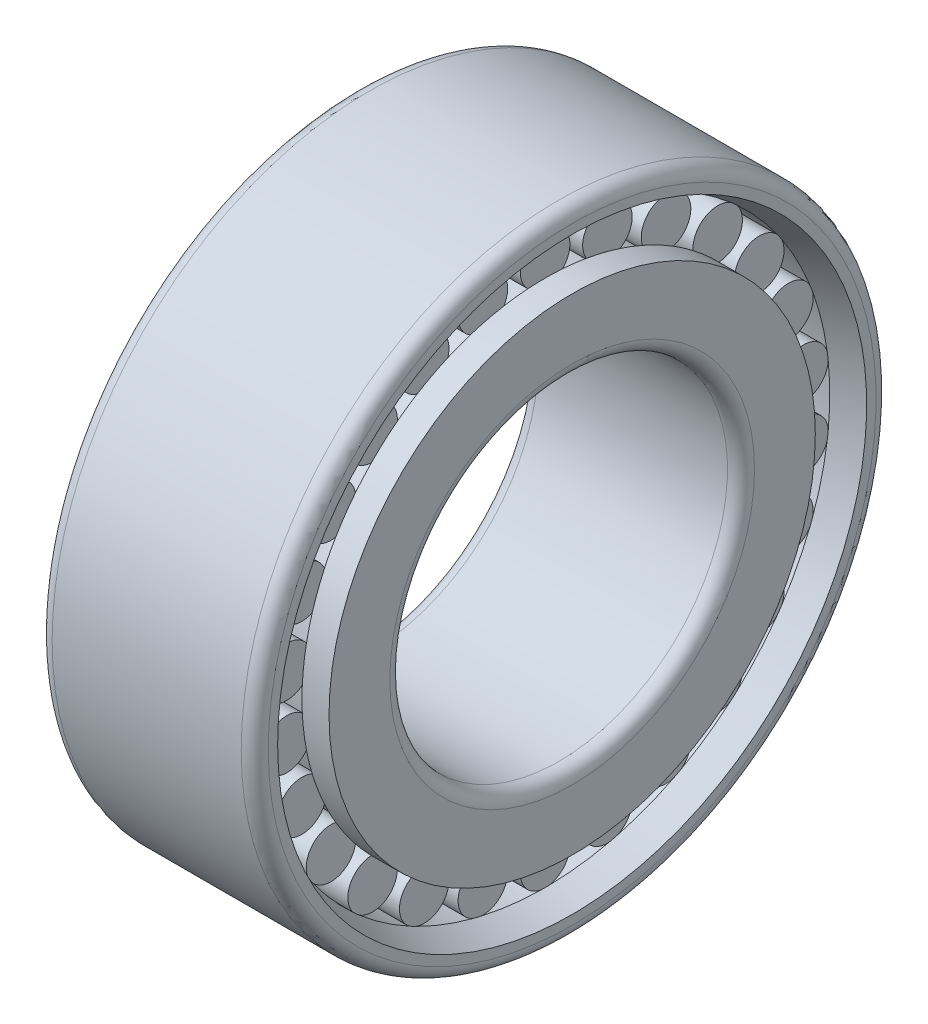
from build123d import *

# Parameters (mm, degrees)
SKETCH2_W               = 4
SKETCH2_H               = 1.833333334
CIRCULAR_PATTERN1_COUNT = 26
FILLET1_R               = 1


with BuildPart() as part:
    # Sketch1 → Revolve1 (revolve)
    with BuildSketch(Plane.XY, mode=Mode.PRIVATE) as revolve1_sk:
        Polygon((-8, 18), (-8, 12.5), (8, 12.5), (8, 18), (6, 18), (6, 17.45), (2, 17.45), (2, 18), (-2, 18), (-2, 17.45), (-6, 17.45), (-6, 18), align=None)
    revolve(revolve1_sk.sketch.rotate(Axis((-29.054415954, 0, 0), (1, 0, 0)), 90), axis=Axis((-29.054415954, 0, 0), (1, 0, 0)))

    # Sketch2 → Revolve2 (revolve)
    with BuildSketch(Plane.XY):
        with Locations((4, 20.18)):
            Rectangle(SKETCH2_W, SKETCH2_H)
        with Locations((-4, 20.18)):
            Rectangle(SKETCH2_W, SKETCH2_H)
    revolve2 = revolve(axis=Axis((-4.611706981, 19.263333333, 0), (1, 0, 0)))

    # Sketch3 → Revolve3 (revolve)
    with BuildSketch(Plane.XY, mode=Mode.PRIVATE) as revolve3_sk:
        Polygon((6, 21.076666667), (8, 21.804607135), (8, 23.5), (-8, 23.5), (-8, 21.804607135), (-6, 21.076666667), align=None)
    revolve(revolve3_sk.sketch.rotate(Axis((-4.430087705, 0, 0), (1, 0, 0)), 4.088815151), axis=Axis((-4.430087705, 0, 0), (1, 0, 0)))

    # Circular-Pattern1: Revolve2 ×26 about axis
    circular_pattern1_axis = Axis((0, 0, 0), (1, 0, 0))
    for i in range(1, CIRCULAR_PATTERN1_COUNT):
        add(revolve2.rotate(circular_pattern1_axis, i * 360 / CIRCULAR_PATTERN1_COUNT))

    # Fillet1
    fillet1_edges = [part.edges().sort_by_distance(p)[0] for p in [
        (8, 0, -12.5),
        (-8, 0, -12.5),
        (8, -23.440185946, -1.675614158),
        (-8, -23.440185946, -1.675614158),
    ]]
    fillet(fillet1_edges, radius=FILLET1_R)


solid = part.part
